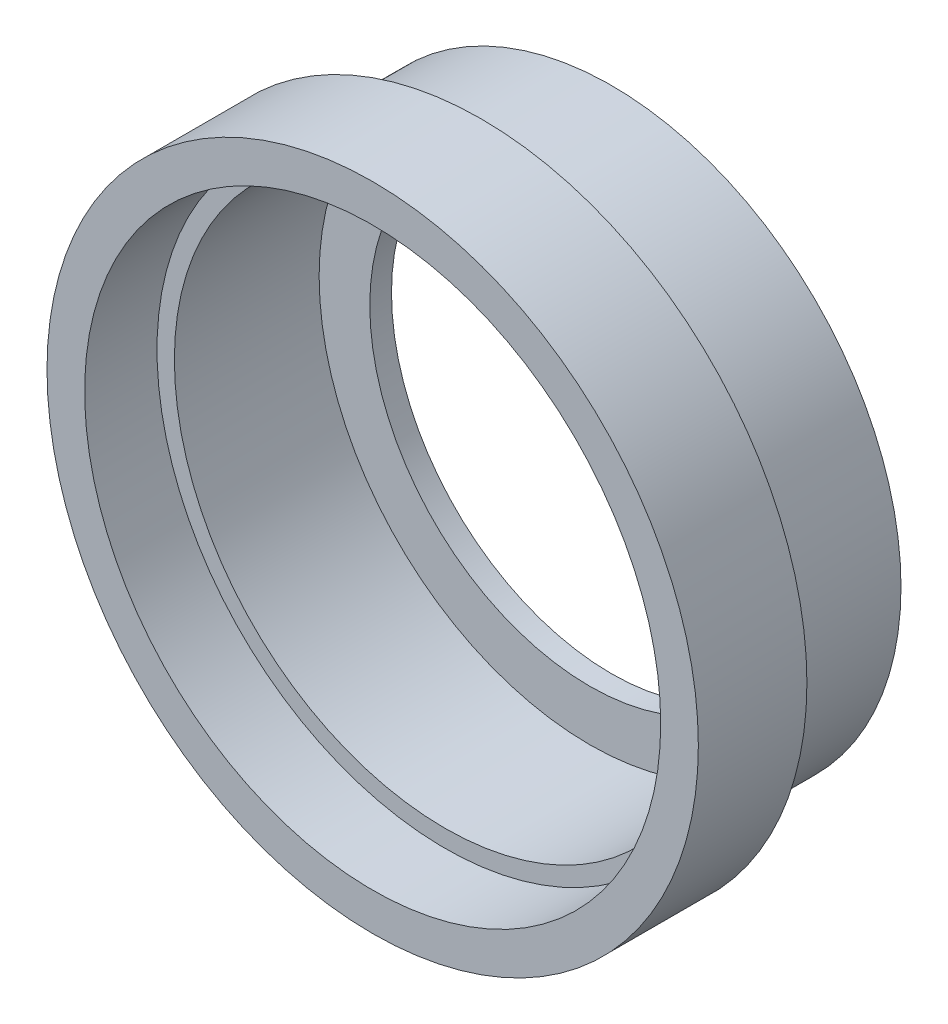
from build123d import *

# Parameters (mm, degrees)
SKETCH1_R          = 25.4
EXTRUDE1_DEPTH     = 11.43
SKETCH2_R          = 28.575
EXTRUDE2_DEPTH     = 9.525
SKETCH3_R          = 19.304
CUT_EXTRUDE1_DEPTH = 46.521129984
SKETCH4_R          = 25.273
CUT_EXTRUDE3_DEPTH = 6.35
SKETCH5_R          = 23.749
CUT_EXTRUDE4_DEPTH = 12.7


with BuildPart() as part:
    # Sketch1 → Extrude1 (new body)
    with BuildSketch(Plane.XY):
        Circle(SKETCH1_R)
    extrude(amount=EXTRUDE1_DEPTH)

    # Sketch2 → Extrude2 (add)
    with BuildSketch(Plane.XY.offset(11.43)):
        with Locations(Location((0, 0, 0), (0, 0, 180))):
            Circle(SKETCH2_R)
    extrude(amount=EXTRUDE2_DEPTH)

    # Sketch3 → Cut-Extrude1 (cut, through all)
    with BuildSketch(Plane(origin=(0, 0, 0), x_dir=(-1, 0, 0), z_dir=(0, 0, -1))):
        Circle(SKETCH3_R)
    extrude(amount=-CUT_EXTRUDE1_DEPTH, mode=Mode.SUBTRACT)

    # Sketch4 → Cut-Extrude3 (cut)
    with BuildSketch(Plane.XY.offset(20.955)):
        Circle(SKETCH4_R)
    extrude(amount=-CUT_EXTRUDE3_DEPTH, mode=Mode.SUBTRACT)

    # Sketch5 → Cut-Extrude4 (cut)
    with BuildSketch(Plane.XY.offset(14.605)):
        Circle(SKETCH5_R)
    extrude(amount=-CUT_EXTRUDE4_DEPTH, mode=Mode.SUBTRACT)


solid = part.part
